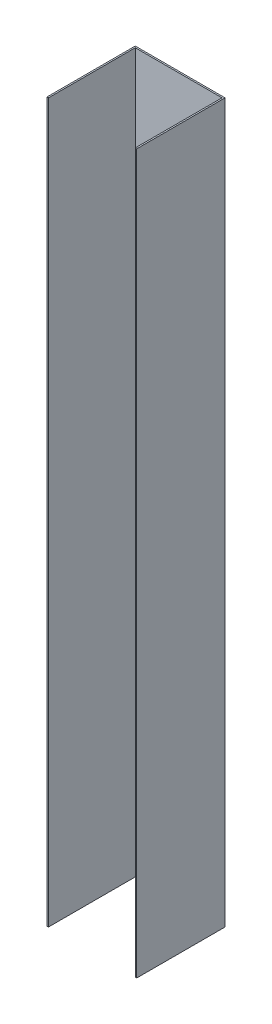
from build123d import *

# Parameters (mm, degrees)
EW_EXTRUDE_DEPTH = 480


with BuildPart() as part:
    # EW_SKETCH → EW_EXTRUDE (new body)
    with BuildSketch(Plane(origin=(0, 0, 0), x_dir=(1, 0, 0), z_dir=(0, 1, 0))):
        Polygon((-30, 0), (30, 0), (30, -59), (29, -59), (29, -1), (-29, -1), (-29, -59), (-30, -59), align=None)
    extrude(amount=EW_EXTRUDE_DEPTH)


solid = part.part
